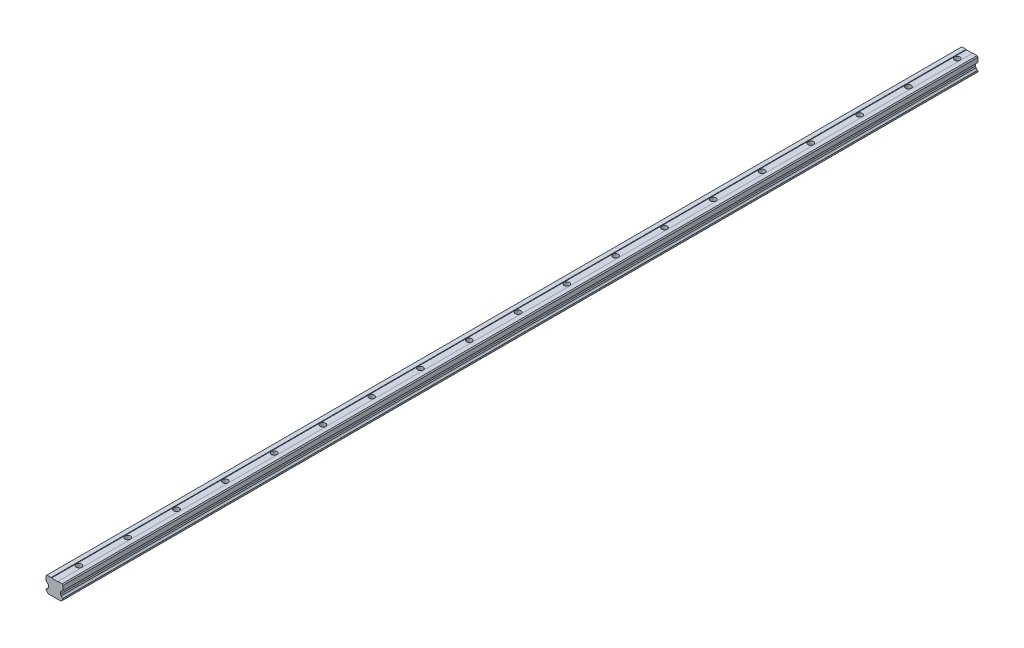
from build123d import *

# Parameters (mm, degrees)
LINEAR_AUSTRAGEN1_DEPTH                              = 750
LINEAR_AUSTRAGEN1_DEPTH_BACK                         = 750
STIRNSENKUNG_F_R_M8_ZYLINDERSCHRAUBE_MIT_D           = 9
STIRNSENKUNG_F_R_M8_ZYLINDERSCHRAUBE_MIT_CBORE_D     = 15
STIRNSENKUNG_F_R_M8_ZYLINDERSCHRAUBE_MIT_CBORE_DEPTH = 8.6
LINEARES_MUSTER1_COUNT                               = 19
LINEARES_MUSTER1_PITCH                               = 80


with BuildPart() as part:
    # Skizze1 → Linear austragen1 (new, two sides: drawn at the far end of the back side and taken through both)
    with BuildSketch(Plane.XY.offset(-LINEAR_AUSTRAGEN1_DEPTH_BACK)):
        with BuildLine():
            Line((-14, 17.603764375), (-13.434314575, 17.603764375))
            Line((-13.434314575, 17.603764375), (-9.6, 13.7694498))
            Line((-9.6, 13.7694498), (-9.6, 10.149517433))
            Line((-9.6, 10.149517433), (-10.898782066, 8.850735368))
            ThreePointArc((-10.898782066, 8.850735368), (-11.824346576, 7.286852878), (-13.439085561, 6.453176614))
            ThreePointArc((-13.439085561, 6.453176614), (-13.554623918, 6.383885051), (-13.6, 6.257032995))
            Line((-13.6, 6.257032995), (-13.6, 3.950508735))
            ThreePointArc((-13.6, 3.950508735), (-13.554623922, 3.823656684), (-13.439085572, 3.754365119))
            ThreePointArc((-13.439085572, 3.754365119), (-11.824347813, 2.920689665), (-10.898783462, 1.356808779))
            Line((-10.898783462, 1.356808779), (-10.545739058, 1.003764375))
            Line((-10.545739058, 1.003764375), (10.545739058, 1.003764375))
            Line((10.545739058, 1.003764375), (10.898783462, 1.356808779))
            ThreePointArc((10.898783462, 1.356808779), (11.824347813, 2.920689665), (13.439085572, 3.754365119))
            ThreePointArc((13.439085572, 3.754365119), (13.554623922, 3.823656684), (13.6, 3.950508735))
            Line((13.6, 3.950508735), (13.6, 6.257032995))
            ThreePointArc((13.6, 6.257032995), (13.554623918, 6.383885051), (13.439085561, 6.453176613))
            ThreePointArc((13.439085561, 6.453176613), (11.824346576, 7.286852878), (10.898782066, 8.850735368))
            Line((10.898782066, 8.850735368), (9.6, 10.149517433))
            Line((9.6, 10.149517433), (9.6, 13.7694498))
            Line((9.6, 13.7694498), (13.384302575, 17.553752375))
            Line((13.384302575, 17.553752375), (14, 17.553752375))
            Line((14, 17.553752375), (14, 25.103767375))
            Line((14, 25.103767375), (12.5, 26.603764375))
            Line((12.5, 26.603764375), (5.5, 26.603764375))
            Line((5.5, 26.603764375), (5, 26.103764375))
            Line((5, 26.103764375), (-5, 26.103764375))
            Line((-5, 26.103764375), (-5.5, 26.603764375))
            Line((-5.5, 26.603764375), (-12.499938, 26.603764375))
            Line((-12.499938, 26.603764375), (-14, 25.103694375))
            Line((-14, 25.103694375), (-14, 17.603764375))
        make_face()
    extrude(amount=LINEAR_AUSTRAGEN1_DEPTH + LINEAR_AUSTRAGEN1_DEPTH_BACK)

    # Stirnsenkung f_r M8 Zylinderschraube mit (through all)
    with Locations(Plane(origin=(0, 1.003764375, 710), x_dir=(0, 0, -1), z_dir=(0, -1, 0))):
        with Locations((0, 0)):
            stirnsenkung_f_r_m8_zylinderschraube_mit = CounterBoreHole(STIRNSENKUNG_F_R_M8_ZYLINDERSCHRAUBE_MIT_D / 2, STIRNSENKUNG_F_R_M8_ZYLINDERSCHRAUBE_MIT_CBORE_D / 2, STIRNSENKUNG_F_R_M8_ZYLINDERSCHRAUBE_MIT_CBORE_DEPTH)

    # Lineares Muster1: Stirnsenkung f_r M8 Zylinderschraube mit ×19
    with Locations(*[(0, 0, -i * LINEARES_MUSTER1_PITCH) for i in range(1, LINEARES_MUSTER1_COUNT)]):
        add(stirnsenkung_f_r_m8_zylinderschraube_mit, mode=Mode.SUBTRACT)


solid = part.part
